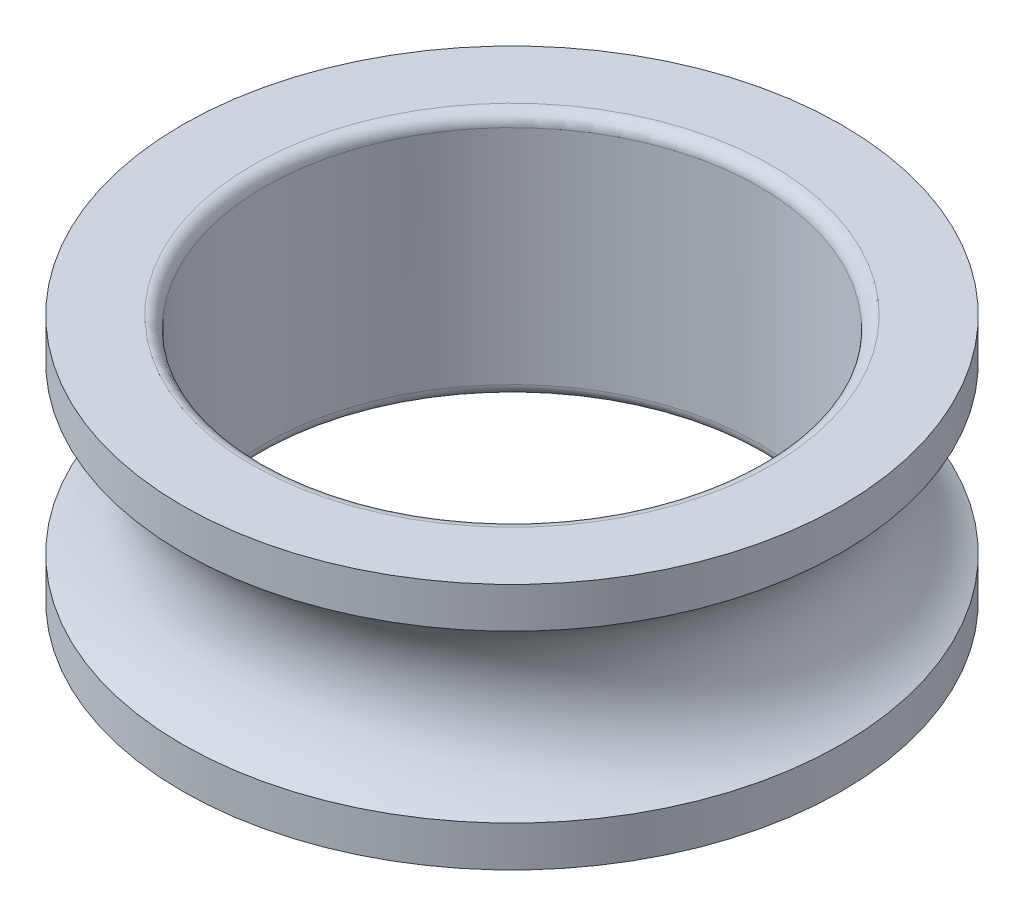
ISO-10303-21;
HEADER;
FILE_DESCRIPTION(('STEP AP214'),'2;1');
FILE_NAME('part.step','',(''),(''),'','','');
FILE_SCHEMA(('AUTOMOTIVE_DESIGN { 1 0 10303 214 1 1 1 1 }'));
ENDSEC;
DATA;
#1=APPLICATION_CONTEXT('core data for automotive mechanical design processes');
#2=APPLICATION_PROTOCOL_DEFINITION('international standard','automotive_design',2000,#1);
#3=PRODUCT_CONTEXT('',#1,'mechanical');
#4=PRODUCT('Part','Part','',(#3));
#5=PRODUCT_RELATED_PRODUCT_CATEGORY('part','',(#4));
#6=PRODUCT_DEFINITION_FORMATION('','',#4);
#7=PRODUCT_DEFINITION_CONTEXT('part definition',#1,'design');
#8=PRODUCT_DEFINITION('design','',#6,#7);
#9=PRODUCT_DEFINITION_SHAPE('','',#8);
#10=(LENGTH_UNIT() NAMED_UNIT(*) SI_UNIT(.MILLI.,.METRE.));
#11=(NAMED_UNIT(*) PLANE_ANGLE_UNIT() SI_UNIT($,.RADIAN.));
#12=(NAMED_UNIT(*) SI_UNIT($,.STERADIAN.) SOLID_ANGLE_UNIT());
#13=UNCERTAINTY_MEASURE_WITH_UNIT(LENGTH_MEASURE(1.E-05),#10,'distance_accuracy_value','');
#14=(GEOMETRIC_REPRESENTATION_CONTEXT(3) GLOBAL_UNCERTAINTY_ASSIGNED_CONTEXT((#13)) GLOBAL_UNIT_ASSIGNED_CONTEXT((#10,
#11,#12)) REPRESENTATION_CONTEXT('',''));
#15=CARTESIAN_POINT('',(0.,0.,0.));
#16=DIRECTION('',(0.,0.,1.));
#17=DIRECTION('',(1.,0.,0.));
#18=AXIS2_PLACEMENT_3D('',#15,#16,#17);
#19=CARTESIAN_POINT('',(0.,-3.,0.));
#20=DIRECTION('',(0.,1.,0.));
#21=DIRECTION('',(0.,0.,1.));
#22=AXIS2_PLACEMENT_3D('',#19,#20,#21);
#23=CYLINDRICAL_SURFACE('',#22,7.99999999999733);
#24=CARTESIAN_POINT('',(0.,-3.,0.));
#25=DIRECTION('',(0.,1.,0.));
#26=DIRECTION('',(0.,0.,1.));
#27=AXIS2_PLACEMENT_3D('',#24,#25,#26);
#28=CIRCLE('',#27,8.);
#29=CARTESIAN_POINT('',(0.,-3.,8.));
#30=VERTEX_POINT('',#29);
#31=EDGE_CURVE('E59',#30,#30,#28,.T.);
#32=ORIENTED_EDGE('',*,*,#31,.T.);
#33=EDGE_LOOP('',(#32));
#34=FACE_BOUND('',#33,.T.);
#35=CARTESIAN_POINT('',(0.,-2.01556443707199,0.));
#36=DIRECTION('',(0.,1.,0.));
#37=DIRECTION('',(0.,0.,1.));
#38=AXIS2_PLACEMENT_3D('',#35,#36,#37);
#39=CIRCLE('',#38,7.99999999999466);
#40=CARTESIAN_POINT('',(0.,-2.01556443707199,7.99999999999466));
#41=VERTEX_POINT('',#40);
#42=EDGE_CURVE('E50',#41,#41,#39,.T.);
#43=ORIENTED_EDGE('',*,*,#42,.F.);
#44=EDGE_LOOP('',(#43));
#45=FACE_BOUND('',#44,.T.);
#46=ADVANCED_FACE('F30',(#34,#45),#23,.T.);
#47=CARTESIAN_POINT('',(0.,0.,0.));
#48=DIRECTION('',(0.,1.,0.));
#49=DIRECTION('',(0.,0.,1.));
#50=AXIS2_PLACEMENT_3D('',#47,#48,#49);
#51=TOROIDAL_SURFACE('',#50,9.,2.25);
#52=ORIENTED_EDGE('',*,*,#42,.T.);
#53=EDGE_LOOP('',(#52));
#54=FACE_BOUND('',#53,.T.);
#55=CARTESIAN_POINT('',(0.,2.01556443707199,0.));
#56=DIRECTION('',(0.,1.,0.));
#57=DIRECTION('',(0.,0.,1.));
#58=AXIS2_PLACEMENT_3D('',#55,#56,#57);
#59=CIRCLE('',#58,7.99999999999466);
#60=CARTESIAN_POINT('',(0.,2.01556443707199,7.99999999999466));
#61=VERTEX_POINT('',#60);
#62=EDGE_CURVE('E53',#61,#61,#59,.T.);
#63=ORIENTED_EDGE('',*,*,#62,.F.);
#64=EDGE_LOOP('',(#63));
#65=FACE_BOUND('',#64,.T.);
#66=ADVANCED_FACE('F79',(#54,#65),#51,.F.);
#67=CARTESIAN_POINT('',(0.,-3.,0.));
#68=DIRECTION('',(0.,1.,0.));
#69=DIRECTION('',(0.,0.,1.));
#70=AXIS2_PLACEMENT_3D('',#67,#68,#69);
#71=CYLINDRICAL_SURFACE('',#70,7.99999999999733);
#72=ORIENTED_EDGE('',*,*,#62,.T.);
#73=EDGE_LOOP('',(#72));
#74=FACE_BOUND('',#73,.T.);
#75=CARTESIAN_POINT('',(0.,3.,0.));
#76=DIRECTION('',(0.,1.,0.));
#77=DIRECTION('',(0.,0.,1.));
#78=AXIS2_PLACEMENT_3D('',#75,#76,#77);
#79=CIRCLE('',#78,8.);
#80=CARTESIAN_POINT('',(0.,3.,8.));
#81=VERTEX_POINT('',#80);
#82=EDGE_CURVE('E56',#81,#81,#79,.T.);
#83=ORIENTED_EDGE('',*,*,#82,.F.);
#84=EDGE_LOOP('',(#83));
#85=FACE_BOUND('',#84,.T.);
#86=ADVANCED_FACE('F84',(#74,#85),#71,.T.);
#87=CARTESIAN_POINT('',(6.,3.,0.));
#88=DIRECTION('',(0.,1.,0.));
#89=DIRECTION('',(0.,0.,1.));
#90=AXIS2_PLACEMENT_3D('',#87,#88,#89);
#91=PLANE('',#90);
#92=CARTESIAN_POINT('',(0.,3.,0.));
#93=DIRECTION('',(0.,1.,0.));
#94=DIRECTION('',(0.,0.,1.));
#95=AXIS2_PLACEMENT_3D('',#92,#93,#94);
#96=CIRCLE('',#95,6.3);
#97=CARTESIAN_POINT('',(0.,3.,6.3));
#98=VERTEX_POINT('',#97);
#99=EDGE_CURVE('E10',#98,#98,#96,.F.);
#100=ORIENTED_EDGE('',*,*,#99,.T.);
#101=EDGE_LOOP('',(#100));
#102=FACE_BOUND('',#101,.T.);
#103=ORIENTED_EDGE('',*,*,#82,.T.);
#104=EDGE_LOOP('',(#103));
#105=FACE_BOUND('',#104,.T.);
#106=ADVANCED_FACE('F76',(#102,#105),#91,.T.);
#107=CARTESIAN_POINT('',(0.,-3.,0.));
#108=DIRECTION('',(0.,1.,0.));
#109=DIRECTION('',(0.,0.,1.));
#110=AXIS2_PLACEMENT_3D('',#107,#108,#109);
#111=CYLINDRICAL_SURFACE('',#110,6.);
#112=CARTESIAN_POINT('',(0.,-2.7,0.));
#113=DIRECTION('',(0.,-1.,0.));
#114=DIRECTION('',(0.,0.,-1.));
#115=AXIS2_PLACEMENT_3D('',#112,#113,#114);
#116=CIRCLE('',#115,6.);
#117=CARTESIAN_POINT('',(0.,-2.7,-6.));
#118=VERTEX_POINT('',#117);
#119=EDGE_CURVE('E37',#118,#118,#116,.T.);
#120=ORIENTED_EDGE('',*,*,#119,.T.);
#121=EDGE_LOOP('',(#120));
#122=FACE_BOUND('',#121,.T.);
#123=CARTESIAN_POINT('',(0.,2.7,0.));
#124=DIRECTION('',(0.,1.,0.));
#125=DIRECTION('',(0.,0.,1.));
#126=AXIS2_PLACEMENT_3D('',#123,#124,#125);
#127=CIRCLE('',#126,6.);
#128=CARTESIAN_POINT('',(0.,2.7,6.));
#129=VERTEX_POINT('',#128);
#130=EDGE_CURVE('E41',#129,#129,#127,.T.);
#131=ORIENTED_EDGE('',*,*,#130,.T.);
#132=EDGE_LOOP('',(#131));
#133=FACE_BOUND('',#132,.T.);
#134=ADVANCED_FACE('F68',(#122,#133),#111,.F.);
#135=CARTESIAN_POINT('',(8.,-3.,0.));
#136=DIRECTION('',(0.,-1.,0.));
#137=DIRECTION('',(0.,0.,-1.));
#138=AXIS2_PLACEMENT_3D('',#135,#136,#137);
#139=PLANE('',#138);
#140=CARTESIAN_POINT('',(0.,-3.,0.));
#141=DIRECTION('',(0.,-1.,0.));
#142=DIRECTION('',(0.,0.,-1.));
#143=AXIS2_PLACEMENT_3D('',#140,#141,#142);
#144=CIRCLE('',#143,6.3);
#145=CARTESIAN_POINT('',(0.,-3.,-6.3));
#146=VERTEX_POINT('',#145);
#147=EDGE_CURVE('E45',#146,#146,#144,.F.);
#148=ORIENTED_EDGE('',*,*,#147,.T.);
#149=EDGE_LOOP('',(#148));
#150=FACE_BOUND('',#149,.T.);
#151=ORIENTED_EDGE('',*,*,#31,.F.);
#152=EDGE_LOOP('',(#151));
#153=FACE_BOUND('',#152,.T.);
#154=ADVANCED_FACE('F65',(#150,#153),#139,.T.);
#155=CARTESIAN_POINT('',(0.,-2.7,0.));
#156=DIRECTION('',(0.,-1.,0.));
#157=DIRECTION('',(0.,0.,-1.));
#158=AXIS2_PLACEMENT_3D('',#155,#156,#157);
#159=TOROIDAL_SURFACE('',#158,6.3,0.3);
#160=ORIENTED_EDGE('',*,*,#119,.F.);
#161=EDGE_LOOP('',(#160));
#162=FACE_BOUND('',#161,.T.);
#163=ORIENTED_EDGE('',*,*,#147,.F.);
#164=EDGE_LOOP('',(#163));
#165=FACE_BOUND('',#164,.T.);
#166=ADVANCED_FACE('F67',(#162,#165),#159,.T.);
#167=CARTESIAN_POINT('',(0.,2.7,0.));
#168=DIRECTION('',(0.,1.,0.));
#169=DIRECTION('',(0.,0.,1.));
#170=AXIS2_PLACEMENT_3D('',#167,#168,#169);
#171=TOROIDAL_SURFACE('',#170,6.3,0.3);
#172=ORIENTED_EDGE('',*,*,#99,.F.);
#173=EDGE_LOOP('',(#172));
#174=FACE_BOUND('',#173,.T.);
#175=ORIENTED_EDGE('',*,*,#130,.F.);
#176=EDGE_LOOP('',(#175));
#177=FACE_BOUND('',#176,.T.);
#178=ADVANCED_FACE('F32',(#174,#177),#171,.T.);
#179=CLOSED_SHELL('',(#46,#66,#86,#106,#134,#154,#166,#178));
#180=MANIFOLD_SOLID_BREP('B2',#179);
#181=ADVANCED_BREP_SHAPE_REPRESENTATION('',(#18,#180),#14);
#182=SHAPE_DEFINITION_REPRESENTATION(#9,#181);
ENDSEC;
END-ISO-10303-21;
